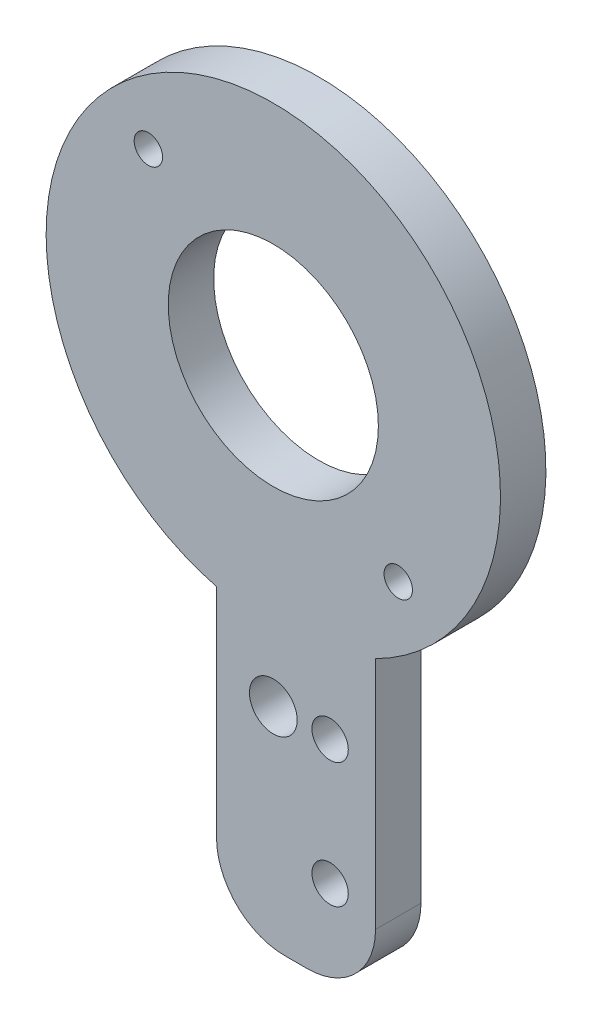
ISO-10303-21;
HEADER;
FILE_DESCRIPTION(('STEP AP214'),'2;1');
FILE_NAME('part.step','',(''),(''),'','','');
FILE_SCHEMA(('AUTOMOTIVE_DESIGN { 1 0 10303 214 1 1 1 1 }'));
ENDSEC;
DATA;
#1=APPLICATION_CONTEXT('core data for automotive mechanical design processes');
#2=APPLICATION_PROTOCOL_DEFINITION('international standard','automotive_design',2000,#1);
#3=PRODUCT_CONTEXT('',#1,'mechanical');
#4=PRODUCT('Part','Part','',(#3));
#5=PRODUCT_RELATED_PRODUCT_CATEGORY('part','',(#4));
#6=PRODUCT_DEFINITION_FORMATION('','',#4);
#7=PRODUCT_DEFINITION_CONTEXT('part definition',#1,'design');
#8=PRODUCT_DEFINITION('design','',#6,#7);
#9=PRODUCT_DEFINITION_SHAPE('','',#8);
#10=(LENGTH_UNIT() NAMED_UNIT(*) SI_UNIT(.MILLI.,.METRE.));
#11=(NAMED_UNIT(*) PLANE_ANGLE_UNIT() SI_UNIT($,.RADIAN.));
#12=(NAMED_UNIT(*) SI_UNIT($,.STERADIAN.) SOLID_ANGLE_UNIT());
#13=UNCERTAINTY_MEASURE_WITH_UNIT(LENGTH_MEASURE(1.E-05),#10,'distance_accuracy_value','');
#14=(GEOMETRIC_REPRESENTATION_CONTEXT(3) GLOBAL_UNCERTAINTY_ASSIGNED_CONTEXT((#13)) GLOBAL_UNIT_ASSIGNED_CONTEXT((#10,
#11,#12)) REPRESENTATION_CONTEXT('',''));
#15=CARTESIAN_POINT('',(0.,0.,0.));
#16=DIRECTION('',(0.,0.,1.));
#17=DIRECTION('',(1.,0.,0.));
#18=AXIS2_PLACEMENT_3D('',#15,#16,#17);
#19=CARTESIAN_POINT('',(0.,0.,4.));
#20=DIRECTION('',(0.,0.,1.));
#21=DIRECTION('',(1.,0.,0.));
#22=AXIS2_PLACEMENT_3D('',#19,#20,#21);
#23=PLANE('',#22);
#24=CARTESIAN_POINT('',(-11.,11.,4.));
#25=DIRECTION('',(0.,0.,1.));
#26=DIRECTION('',(1.,0.,0.));
#27=AXIS2_PLACEMENT_3D('',#24,#25,#26);
#28=CIRCLE('',#27,1.25);
#29=CARTESIAN_POINT('',(-9.75,11.,4.));
#30=VERTEX_POINT('',#29);
#31=EDGE_CURVE('E192',#30,#30,#28,.T.);
#32=ORIENTED_EDGE('',*,*,#31,.F.);
#33=EDGE_LOOP('',(#32));
#34=FACE_BOUND('',#33,.T.);
#35=CARTESIAN_POINT('',(11.,-11.,4.));
#36=DIRECTION('',(0.,0.,1.));
#37=DIRECTION('',(1.,0.,0.));
#38=AXIS2_PLACEMENT_3D('',#35,#36,#37);
#39=CIRCLE('',#38,1.25);
#40=CARTESIAN_POINT('',(12.25,-11.,4.));
#41=VERTEX_POINT('',#40);
#42=EDGE_CURVE('E194',#41,#41,#39,.T.);
#43=ORIENTED_EDGE('',*,*,#42,.F.);
#44=EDGE_LOOP('',(#43));
#45=FACE_BOUND('',#44,.T.);
#46=CARTESIAN_POINT('',(0.,-26.,4.));
#47=DIRECTION('',(0.,0.,1.));
#48=DIRECTION('',(1.,0.,0.));
#49=AXIS2_PLACEMENT_3D('',#46,#47,#48);
#50=CIRCLE('',#49,2.1);
#51=CARTESIAN_POINT('',(2.1,-26.,4.));
#52=VERTEX_POINT('',#51);
#53=EDGE_CURVE('E202',#52,#52,#50,.T.);
#54=ORIENTED_EDGE('',*,*,#53,.F.);
#55=EDGE_LOOP('',(#54));
#56=FACE_BOUND('',#55,.T.);
#57=CARTESIAN_POINT('',(5.00000000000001,-26.,4.));
#58=DIRECTION('',(0.,0.,1.));
#59=DIRECTION('',(1.,0.,0.));
#60=AXIS2_PLACEMENT_3D('',#57,#58,#59);
#61=CIRCLE('',#60,1.6);
#62=CARTESIAN_POINT('',(6.6,-26.,4.));
#63=VERTEX_POINT('',#62);
#64=EDGE_CURVE('E208',#63,#63,#61,.T.);
#65=ORIENTED_EDGE('',*,*,#64,.F.);
#66=EDGE_LOOP('',(#65));
#67=FACE_BOUND('',#66,.T.);
#68=CARTESIAN_POINT('',(5.00000000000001,-37.,4.));
#69=DIRECTION('',(0.,0.,1.));
#70=DIRECTION('',(1.,0.,0.));
#71=AXIS2_PLACEMENT_3D('',#68,#69,#70);
#72=CIRCLE('',#71,1.6);
#73=CARTESIAN_POINT('',(6.60000000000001,-37.,4.));
#74=VERTEX_POINT('',#73);
#75=EDGE_CURVE('E214',#74,#74,#72,.T.);
#76=ORIENTED_EDGE('',*,*,#75,.F.);
#77=EDGE_LOOP('',(#76));
#78=FACE_BOUND('',#77,.T.);
#79=CARTESIAN_POINT('',(0.,0.,4.));
#80=DIRECTION('',(0.,0.,1.));
#81=DIRECTION('',(1.,0.,0.));
#82=AXIS2_PLACEMENT_3D('',#79,#80,#81);
#83=CIRCLE('',#82,20.);
#84=CARTESIAN_POINT('',(9.00000000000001,-17.8605710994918,4.));
#85=VERTEX_POINT('',#84);
#86=CARTESIAN_POINT('',(-4.99999999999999,-19.3649167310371,4.));
#87=VERTEX_POINT('',#86);
#88=EDGE_CURVE('E130',#85,#87,#83,.T.);
#89=ORIENTED_EDGE('',*,*,#88,.T.);
#90=DIRECTION('',(0.,-1.,0.));
#91=VECTOR('',#90,1.);
#92=CARTESIAN_POINT('',(-4.99999999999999,-19.3649167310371,4.));
#93=LINE('',#92,#91);
#94=CARTESIAN_POINT('',(-4.99999999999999,-38.5,4.));
#95=VERTEX_POINT('',#94);
#96=EDGE_CURVE('E88',#87,#95,#93,.T.);
#97=ORIENTED_EDGE('',*,*,#96,.T.);
#98=CARTESIAN_POINT('',(1.00000000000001,-38.5,4.));
#99=DIRECTION('',(0.,0.,1.));
#100=DIRECTION('',(-1.,0.,0.));
#101=AXIS2_PLACEMENT_3D('',#98,#99,#100);
#102=CIRCLE('',#101,6.);
#103=CARTESIAN_POINT('',(1.00000000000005,-44.5,4.));
#104=VERTEX_POINT('',#103);
#105=EDGE_CURVE('E101',#95,#104,#102,.T.);
#106=ORIENTED_EDGE('',*,*,#105,.T.);
#107=DIRECTION('',(1.,0.,0.));
#108=VECTOR('',#107,1.);
#109=CARTESIAN_POINT('',(1.00000000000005,-44.5,4.));
#110=LINE('',#109,#108);
#111=CARTESIAN_POINT('',(2.99999999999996,-44.5,4.));
#112=VERTEX_POINT('',#111);
#113=EDGE_CURVE('E95',#104,#112,#110,.T.);
#114=ORIENTED_EDGE('',*,*,#113,.T.);
#115=CARTESIAN_POINT('',(3.00000000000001,-38.5,4.));
#116=DIRECTION('',(0.,0.,1.));
#117=DIRECTION('',(1.,0.,0.));
#118=AXIS2_PLACEMENT_3D('',#115,#116,#117);
#119=CIRCLE('',#118,6.);
#120=CARTESIAN_POINT('',(9.00000000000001,-38.5,4.));
#121=VERTEX_POINT('',#120);
#122=EDGE_CURVE('E99',#112,#121,#119,.T.);
#123=ORIENTED_EDGE('',*,*,#122,.T.);
#124=DIRECTION('',(0.,1.,0.));
#125=VECTOR('',#124,1.);
#126=CARTESIAN_POINT('',(9.00000000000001,-17.8605710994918,4.));
#127=LINE('',#126,#125);
#128=EDGE_CURVE('E51',#121,#85,#127,.T.);
#129=ORIENTED_EDGE('',*,*,#128,.T.);
#130=EDGE_LOOP('',(#89,#97,#106,#114,#123,#129));
#131=FACE_BOUND('',#130,.T.);
#132=CARTESIAN_POINT('',(0.,0.,4.));
#133=DIRECTION('',(0.,0.,1.));
#134=DIRECTION('',(1.,0.,0.));
#135=AXIS2_PLACEMENT_3D('',#132,#133,#134);
#136=CIRCLE('',#135,9.25);
#137=CARTESIAN_POINT('',(9.25,0.,4.));
#138=VERTEX_POINT('',#137);
#139=EDGE_CURVE('E123',#138,#138,#136,.T.);
#140=ORIENTED_EDGE('',*,*,#139,.F.);
#141=EDGE_LOOP('',(#140));
#142=FACE_BOUND('',#141,.T.);
#143=ADVANCED_FACE('F34',(#34,#45,#56,#67,#78,#131,#142),#23,.T.);
#144=CARTESIAN_POINT('',(0.,0.,0.));
#145=DIRECTION('',(0.,0.,1.));
#146=DIRECTION('',(1.,0.,0.));
#147=AXIS2_PLACEMENT_3D('',#144,#145,#146);
#148=PLANE('',#147);
#149=CARTESIAN_POINT('',(-11.,11.,0.));
#150=DIRECTION('',(0.,0.,1.));
#151=DIRECTION('',(1.,0.,0.));
#152=AXIS2_PLACEMENT_3D('',#149,#150,#151);
#153=CIRCLE('',#152,1.25);
#154=CARTESIAN_POINT('',(-9.75,11.,0.));
#155=VERTEX_POINT('',#154);
#156=EDGE_CURVE('E190',#155,#155,#153,.T.);
#157=ORIENTED_EDGE('',*,*,#156,.T.);
#158=EDGE_LOOP('',(#157));
#159=FACE_BOUND('',#158,.T.);
#160=CARTESIAN_POINT('',(11.,-11.,0.));
#161=DIRECTION('',(0.,0.,1.));
#162=DIRECTION('',(1.,0.,0.));
#163=AXIS2_PLACEMENT_3D('',#160,#161,#162);
#164=CIRCLE('',#163,1.25);
#165=CARTESIAN_POINT('',(12.25,-11.,0.));
#166=VERTEX_POINT('',#165);
#167=EDGE_CURVE('E199',#166,#166,#164,.T.);
#168=ORIENTED_EDGE('',*,*,#167,.T.);
#169=EDGE_LOOP('',(#168));
#170=FACE_BOUND('',#169,.T.);
#171=CARTESIAN_POINT('',(0.,-26.,0.));
#172=DIRECTION('',(0.,0.,1.));
#173=DIRECTION('',(1.,0.,0.));
#174=AXIS2_PLACEMENT_3D('',#171,#172,#173);
#175=CIRCLE('',#174,2.1);
#176=CARTESIAN_POINT('',(2.1,-26.,0.));
#177=VERTEX_POINT('',#176);
#178=EDGE_CURVE('E205',#177,#177,#175,.T.);
#179=ORIENTED_EDGE('',*,*,#178,.T.);
#180=EDGE_LOOP('',(#179));
#181=FACE_BOUND('',#180,.T.);
#182=CARTESIAN_POINT('',(5.00000000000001,-26.,0.));
#183=DIRECTION('',(0.,0.,1.));
#184=DIRECTION('',(1.,0.,0.));
#185=AXIS2_PLACEMENT_3D('',#182,#183,#184);
#186=CIRCLE('',#185,1.6);
#187=CARTESIAN_POINT('',(6.6,-26.,0.));
#188=VERTEX_POINT('',#187);
#189=EDGE_CURVE('E211',#188,#188,#186,.T.);
#190=ORIENTED_EDGE('',*,*,#189,.T.);
#191=EDGE_LOOP('',(#190));
#192=FACE_BOUND('',#191,.T.);
#193=CARTESIAN_POINT('',(5.00000000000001,-37.,0.));
#194=DIRECTION('',(0.,0.,1.));
#195=DIRECTION('',(1.,0.,0.));
#196=AXIS2_PLACEMENT_3D('',#193,#194,#195);
#197=CIRCLE('',#196,1.6);
#198=CARTESIAN_POINT('',(6.60000000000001,-37.,0.));
#199=VERTEX_POINT('',#198);
#200=EDGE_CURVE('E217',#199,#199,#197,.T.);
#201=ORIENTED_EDGE('',*,*,#200,.T.);
#202=EDGE_LOOP('',(#201));
#203=FACE_BOUND('',#202,.T.);
#204=CARTESIAN_POINT('',(0.,0.,0.));
#205=DIRECTION('',(0.,0.,1.));
#206=DIRECTION('',(1.,0.,0.));
#207=AXIS2_PLACEMENT_3D('',#204,#205,#206);
#208=CIRCLE('',#207,20.);
#209=CARTESIAN_POINT('',(9.00000000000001,-17.8605710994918,0.));
#210=VERTEX_POINT('',#209);
#211=CARTESIAN_POINT('',(-4.99999999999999,-19.3649167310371,0.));
#212=VERTEX_POINT('',#211);
#213=EDGE_CURVE('E119',#210,#212,#208,.T.);
#214=ORIENTED_EDGE('',*,*,#213,.F.);
#215=DIRECTION('',(0.,1.,0.));
#216=VECTOR('',#215,1.);
#217=CARTESIAN_POINT('',(9.00000000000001,-17.8605710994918,0.));
#218=LINE('',#217,#216);
#219=CARTESIAN_POINT('',(9.00000000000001,-38.5,0.));
#220=VERTEX_POINT('',#219);
#221=EDGE_CURVE('E80',#220,#210,#218,.T.);
#222=ORIENTED_EDGE('',*,*,#221,.F.);
#223=CARTESIAN_POINT('',(3.00000000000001,-38.5,0.));
#224=DIRECTION('',(0.,0.,1.));
#225=DIRECTION('',(1.,0.,0.));
#226=AXIS2_PLACEMENT_3D('',#223,#224,#225);
#227=CIRCLE('',#226,6.);
#228=CARTESIAN_POINT('',(2.99999999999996,-44.5,0.));
#229=VERTEX_POINT('',#228);
#230=EDGE_CURVE('E74',#229,#220,#227,.T.);
#231=ORIENTED_EDGE('',*,*,#230,.F.);
#232=DIRECTION('',(1.,0.,0.));
#233=VECTOR('',#232,1.);
#234=CARTESIAN_POINT('',(1.00000000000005,-44.5,0.));
#235=LINE('',#234,#233);
#236=CARTESIAN_POINT('',(1.00000000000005,-44.5,0.));
#237=VERTEX_POINT('',#236);
#238=EDGE_CURVE('E109',#237,#229,#235,.T.);
#239=ORIENTED_EDGE('',*,*,#238,.F.);
#240=CARTESIAN_POINT('',(1.00000000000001,-38.5,0.));
#241=DIRECTION('',(0.,0.,1.));
#242=DIRECTION('',(-1.,0.,0.));
#243=AXIS2_PLACEMENT_3D('',#240,#241,#242);
#244=CIRCLE('',#243,6.);
#245=CARTESIAN_POINT('',(-4.99999999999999,-38.5,0.));
#246=VERTEX_POINT('',#245);
#247=EDGE_CURVE('E125',#246,#237,#244,.T.);
#248=ORIENTED_EDGE('',*,*,#247,.F.);
#249=DIRECTION('',(0.,-1.,0.));
#250=VECTOR('',#249,1.);
#251=CARTESIAN_POINT('',(-4.99999999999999,-19.3649167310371,0.));
#252=LINE('',#251,#250);
#253=EDGE_CURVE('E122',#212,#246,#252,.T.);
#254=ORIENTED_EDGE('',*,*,#253,.F.);
#255=EDGE_LOOP('',(#214,#222,#231,#239,#248,#254));
#256=FACE_BOUND('',#255,.T.);
#257=CARTESIAN_POINT('',(0.,0.,0.));
#258=DIRECTION('',(0.,0.,1.));
#259=DIRECTION('',(1.,0.,0.));
#260=AXIS2_PLACEMENT_3D('',#257,#258,#259);
#261=CIRCLE('',#260,9.25);
#262=CARTESIAN_POINT('',(9.25,0.,0.));
#263=VERTEX_POINT('',#262);
#264=EDGE_CURVE('E220',#263,#263,#261,.T.);
#265=ORIENTED_EDGE('',*,*,#264,.T.);
#266=EDGE_LOOP('',(#265));
#267=FACE_BOUND('',#266,.T.);
#268=ADVANCED_FACE('F139',(#159,#170,#181,#192,#203,#256,#267),#148,.F.);
#269=CARTESIAN_POINT('',(0.,0.,4.));
#270=DIRECTION('',(0.,0.,-1.));
#271=DIRECTION('',(-1.,0.,0.));
#272=AXIS2_PLACEMENT_3D('',#269,#270,#271);
#273=CYLINDRICAL_SURFACE('',#272,20.);
#274=ORIENTED_EDGE('',*,*,#213,.T.);
#275=DIRECTION('',(0.,0.,-1.));
#276=VECTOR('',#275,1.);
#277=CARTESIAN_POINT('',(-4.99999999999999,-19.3649167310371,4.));
#278=LINE('',#277,#276);
#279=EDGE_CURVE('E11',#87,#212,#278,.T.);
#280=ORIENTED_EDGE('',*,*,#279,.F.);
#281=ORIENTED_EDGE('',*,*,#88,.F.);
#282=DIRECTION('',(0.,0.,-1.));
#283=VECTOR('',#282,1.);
#284=CARTESIAN_POINT('',(9.00000000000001,-17.8605710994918,4.));
#285=LINE('',#284,#283);
#286=EDGE_CURVE('E115',#85,#210,#285,.T.);
#287=ORIENTED_EDGE('',*,*,#286,.T.);
#288=EDGE_LOOP('',(#274,#280,#281,#287));
#289=FACE_BOUND('',#288,.T.);
#290=ADVANCED_FACE('F36',(#289),#273,.T.);
#291=CARTESIAN_POINT('',(-4.99999999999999,-19.3649167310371,4.));
#292=DIRECTION('',(1.,0.,0.));
#293=DIRECTION('',(0.,1.,0.));
#294=AXIS2_PLACEMENT_3D('',#291,#292,#293);
#295=PLANE('',#294);
#296=ORIENTED_EDGE('',*,*,#253,.T.);
#297=DIRECTION('',(0.,0.,-1.));
#298=VECTOR('',#297,1.);
#299=CARTESIAN_POINT('',(-4.99999999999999,-38.5,4.));
#300=LINE('',#299,#298);
#301=EDGE_CURVE('E43',#95,#246,#300,.T.);
#302=ORIENTED_EDGE('',*,*,#301,.F.);
#303=ORIENTED_EDGE('',*,*,#96,.F.);
#304=ORIENTED_EDGE('',*,*,#279,.T.);
#305=EDGE_LOOP('',(#296,#302,#303,#304));
#306=FACE_BOUND('',#305,.T.);
#307=ADVANCED_FACE('F295',(#306),#295,.F.);
#308=CARTESIAN_POINT('',(1.00000000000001,-38.5,4.));
#309=DIRECTION('',(0.,0.,-1.));
#310=DIRECTION('',(-1.,0.,0.));
#311=AXIS2_PLACEMENT_3D('',#308,#309,#310);
#312=CYLINDRICAL_SURFACE('',#311,6.);
#313=ORIENTED_EDGE('',*,*,#247,.T.);
#314=DIRECTION('',(0.,0.,-1.));
#315=VECTOR('',#314,1.);
#316=CARTESIAN_POINT('',(1.00000000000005,-44.5,4.));
#317=LINE('',#316,#315);
#318=EDGE_CURVE('E110',#104,#237,#317,.T.);
#319=ORIENTED_EDGE('',*,*,#318,.F.);
#320=ORIENTED_EDGE('',*,*,#105,.F.);
#321=ORIENTED_EDGE('',*,*,#301,.T.);
#322=EDGE_LOOP('',(#313,#319,#320,#321));
#323=FACE_BOUND('',#322,.T.);
#324=ADVANCED_FACE('F136',(#323),#312,.T.);
#325=CARTESIAN_POINT('',(1.00000000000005,-44.5,4.));
#326=DIRECTION('',(0.,1.,0.));
#327=DIRECTION('',(0.,0.,1.));
#328=AXIS2_PLACEMENT_3D('',#325,#326,#327);
#329=PLANE('',#328);
#330=ORIENTED_EDGE('',*,*,#238,.T.);
#331=DIRECTION('',(0.,0.,-1.));
#332=VECTOR('',#331,1.);
#333=CARTESIAN_POINT('',(2.99999999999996,-44.5,4.));
#334=LINE('',#333,#332);
#335=EDGE_CURVE('E106',#112,#229,#334,.T.);
#336=ORIENTED_EDGE('',*,*,#335,.F.);
#337=ORIENTED_EDGE('',*,*,#113,.F.);
#338=ORIENTED_EDGE('',*,*,#318,.T.);
#339=EDGE_LOOP('',(#330,#336,#337,#338));
#340=FACE_BOUND('',#339,.T.);
#341=ADVANCED_FACE('F107',(#340),#329,.F.);
#342=CARTESIAN_POINT('',(3.00000000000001,-38.5,4.));
#343=DIRECTION('',(0.,0.,-1.));
#344=DIRECTION('',(-1.,0.,0.));
#345=AXIS2_PLACEMENT_3D('',#342,#343,#344);
#346=CYLINDRICAL_SURFACE('',#345,6.);
#347=ORIENTED_EDGE('',*,*,#230,.T.);
#348=DIRECTION('',(0.,0.,-1.));
#349=VECTOR('',#348,1.);
#350=CARTESIAN_POINT('',(9.00000000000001,-38.5,4.));
#351=LINE('',#350,#349);
#352=EDGE_CURVE('E111',#121,#220,#351,.T.);
#353=ORIENTED_EDGE('',*,*,#352,.F.);
#354=ORIENTED_EDGE('',*,*,#122,.F.);
#355=ORIENTED_EDGE('',*,*,#335,.T.);
#356=EDGE_LOOP('',(#347,#353,#354,#355));
#357=FACE_BOUND('',#356,.T.);
#358=ADVANCED_FACE('F113',(#357),#346,.T.);
#359=CARTESIAN_POINT('',(9.00000000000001,-17.8605710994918,4.));
#360=DIRECTION('',(-1.,0.,0.));
#361=DIRECTION('',(0.,-1.,0.));
#362=AXIS2_PLACEMENT_3D('',#359,#360,#361);
#363=PLANE('',#362);
#364=ORIENTED_EDGE('',*,*,#221,.T.);
#365=ORIENTED_EDGE('',*,*,#286,.F.);
#366=ORIENTED_EDGE('',*,*,#128,.F.);
#367=ORIENTED_EDGE('',*,*,#352,.T.);
#368=EDGE_LOOP('',(#364,#365,#366,#367));
#369=FACE_BOUND('',#368,.T.);
#370=ADVANCED_FACE('F144',(#369),#363,.F.);
#371=CARTESIAN_POINT('',(0.,0.,4.));
#372=DIRECTION('',(0.,0.,-1.));
#373=DIRECTION('',(-1.,0.,0.));
#374=AXIS2_PLACEMENT_3D('',#371,#372,#373);
#375=CYLINDRICAL_SURFACE('',#374,9.25);
#376=ORIENTED_EDGE('',*,*,#139,.T.);
#377=EDGE_LOOP('',(#376));
#378=FACE_BOUND('',#377,.T.);
#379=ORIENTED_EDGE('',*,*,#264,.F.);
#380=EDGE_LOOP('',(#379));
#381=FACE_BOUND('',#380,.T.);
#382=ADVANCED_FACE('F146',(#378,#381),#375,.F.);
#383=CARTESIAN_POINT('',(5.00000000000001,-37.,4.));
#384=DIRECTION('',(0.,0.,1.));
#385=DIRECTION('',(1.,0.,0.));
#386=AXIS2_PLACEMENT_3D('',#383,#384,#385);
#387=CYLINDRICAL_SURFACE('',#386,1.6);
#388=ORIENTED_EDGE('',*,*,#200,.F.);
#389=EDGE_LOOP('',(#388));
#390=FACE_BOUND('',#389,.T.);
#391=ORIENTED_EDGE('',*,*,#75,.T.);
#392=EDGE_LOOP('',(#391));
#393=FACE_BOUND('',#392,.T.);
#394=ADVANCED_FACE('F152',(#390,#393),#387,.F.);
#395=CARTESIAN_POINT('',(5.00000000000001,-26.,4.));
#396=DIRECTION('',(0.,0.,1.));
#397=DIRECTION('',(1.,0.,0.));
#398=AXIS2_PLACEMENT_3D('',#395,#396,#397);
#399=CYLINDRICAL_SURFACE('',#398,1.6);
#400=ORIENTED_EDGE('',*,*,#189,.F.);
#401=EDGE_LOOP('',(#400));
#402=FACE_BOUND('',#401,.T.);
#403=ORIENTED_EDGE('',*,*,#64,.T.);
#404=EDGE_LOOP('',(#403));
#405=FACE_BOUND('',#404,.T.);
#406=ADVANCED_FACE('F169',(#402,#405),#399,.F.);
#407=CARTESIAN_POINT('',(0.,-26.,4.));
#408=DIRECTION('',(0.,0.,1.));
#409=DIRECTION('',(1.,0.,0.));
#410=AXIS2_PLACEMENT_3D('',#407,#408,#409);
#411=CYLINDRICAL_SURFACE('',#410,2.1);
#412=ORIENTED_EDGE('',*,*,#178,.F.);
#413=EDGE_LOOP('',(#412));
#414=FACE_BOUND('',#413,.T.);
#415=ORIENTED_EDGE('',*,*,#53,.T.);
#416=EDGE_LOOP('',(#415));
#417=FACE_BOUND('',#416,.T.);
#418=ADVANCED_FACE('F173',(#414,#417),#411,.F.);
#419=CARTESIAN_POINT('',(11.,-11.,4.));
#420=DIRECTION('',(0.,0.,1.));
#421=DIRECTION('',(1.,0.,0.));
#422=AXIS2_PLACEMENT_3D('',#419,#420,#421);
#423=CYLINDRICAL_SURFACE('',#422,1.25);
#424=ORIENTED_EDGE('',*,*,#167,.F.);
#425=EDGE_LOOP('',(#424));
#426=FACE_BOUND('',#425,.T.);
#427=ORIENTED_EDGE('',*,*,#42,.T.);
#428=EDGE_LOOP('',(#427));
#429=FACE_BOUND('',#428,.T.);
#430=ADVANCED_FACE('F177',(#426,#429),#423,.F.);
#431=CARTESIAN_POINT('',(-11.,11.,4.));
#432=DIRECTION('',(0.,0.,1.));
#433=DIRECTION('',(1.,0.,0.));
#434=AXIS2_PLACEMENT_3D('',#431,#432,#433);
#435=CYLINDRICAL_SURFACE('',#434,1.25);
#436=ORIENTED_EDGE('',*,*,#156,.F.);
#437=EDGE_LOOP('',(#436));
#438=FACE_BOUND('',#437,.T.);
#439=ORIENTED_EDGE('',*,*,#31,.T.);
#440=EDGE_LOOP('',(#439));
#441=FACE_BOUND('',#440,.T.);
#442=ADVANCED_FACE('F181',(#438,#441),#435,.F.);
#443=CLOSED_SHELL('',(#143,#268,#290,#307,#324,#341,#358,#370,#382,#394,#406,#418,#430,#442));
#444=MANIFOLD_SOLID_BREP('B2',#443);
#445=ADVANCED_BREP_SHAPE_REPRESENTATION('',(#18,#444),#14);
#446=SHAPE_DEFINITION_REPRESENTATION(#9,#445);
ENDSEC;
END-ISO-10303-21;
